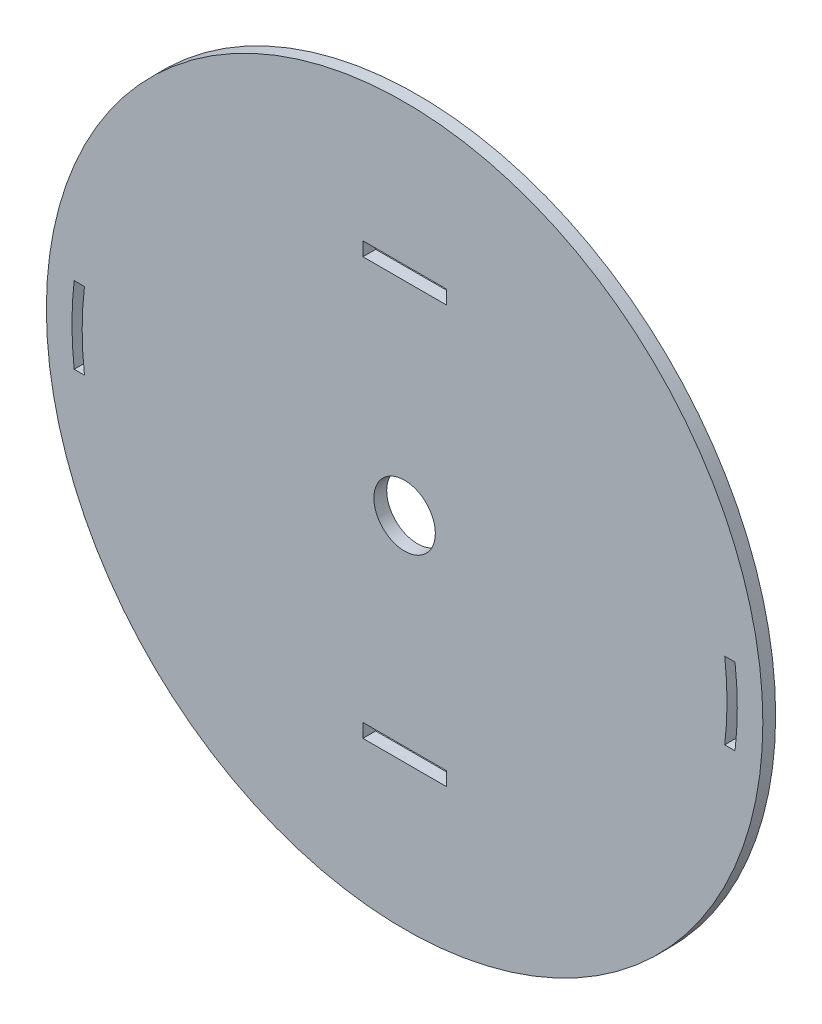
ISO-10303-21;
HEADER;
FILE_DESCRIPTION(('STEP AP214'),'2;1');
FILE_NAME('part.step','',(''),(''),'','','');
FILE_SCHEMA(('AUTOMOTIVE_DESIGN { 1 0 10303 214 1 1 1 1 }'));
ENDSEC;
DATA;
#1=APPLICATION_CONTEXT('core data for automotive mechanical design processes');
#2=APPLICATION_PROTOCOL_DEFINITION('international standard','automotive_design',2000,#1);
#3=PRODUCT_CONTEXT('',#1,'mechanical');
#4=PRODUCT('Part','Part','',(#3));
#5=PRODUCT_RELATED_PRODUCT_CATEGORY('part','',(#4));
#6=PRODUCT_DEFINITION_FORMATION('','',#4);
#7=PRODUCT_DEFINITION_CONTEXT('part definition',#1,'design');
#8=PRODUCT_DEFINITION('design','',#6,#7);
#9=PRODUCT_DEFINITION_SHAPE('','',#8);
#10=(LENGTH_UNIT() NAMED_UNIT(*) SI_UNIT(.MILLI.,.METRE.));
#11=(NAMED_UNIT(*) PLANE_ANGLE_UNIT() SI_UNIT($,.RADIAN.));
#12=(NAMED_UNIT(*) SI_UNIT($,.STERADIAN.) SOLID_ANGLE_UNIT());
#13=UNCERTAINTY_MEASURE_WITH_UNIT(LENGTH_MEASURE(1.E-05),#10,'distance_accuracy_value','');
#14=(GEOMETRIC_REPRESENTATION_CONTEXT(3) GLOBAL_UNCERTAINTY_ASSIGNED_CONTEXT((#13)) GLOBAL_UNIT_ASSIGNED_CONTEXT((#10,
#11,#12)) REPRESENTATION_CONTEXT('',''));
#15=CARTESIAN_POINT('',(0.,0.,0.));
#16=DIRECTION('',(0.,0.,1.));
#17=DIRECTION('',(1.,0.,0.));
#18=AXIS2_PLACEMENT_3D('',#15,#16,#17);
#19=CARTESIAN_POINT('',(0.,39.1553072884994,2.5));
#20=DIRECTION('',(0.,0.,1.));
#21=DIRECTION('',(1.,0.,0.));
#22=AXIS2_PLACEMENT_3D('',#19,#20,#21);
#23=PLANE('',#22);
#24=CARTESIAN_POINT('',(0.,39.1553072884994,2.5));
#25=DIRECTION('',(0.,0.,1.));
#26=DIRECTION('',(1.,0.,0.));
#27=AXIS2_PLACEMENT_3D('',#24,#25,#26);
#28=CIRCLE('',#27,6.);
#29=CARTESIAN_POINT('',(5.99999999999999,39.1553072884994,2.5));
#30=VERTEX_POINT('',#29);
#31=EDGE_CURVE('E180',#30,#30,#28,.T.);
#32=ORIENTED_EDGE('',*,*,#31,.F.);
#33=EDGE_LOOP('',(#32));
#34=FACE_BOUND('',#33,.T.);
#35=CARTESIAN_POINT('',(0.,39.1553072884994,2.5));
#36=DIRECTION('',(0.,0.,1.));
#37=DIRECTION('',(1.,0.,0.));
#38=AXIS2_PLACEMENT_3D('',#35,#36,#37);
#39=CIRCLE('',#38,70.0000000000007);
#40=CARTESIAN_POINT('',(70.0000000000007,39.1553072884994,2.5));
#41=VERTEX_POINT('',#40);
#42=EDGE_CURVE('E11',#41,#41,#39,.T.);
#43=ORIENTED_EDGE('',*,*,#42,.T.);
#44=EDGE_LOOP('',(#43));
#45=FACE_BOUND('',#44,.T.);
#46=DIRECTION('',(-1.,0.,0.));
#47=VECTOR('',#46,1.);
#48=CARTESIAN_POINT('',(62.5519783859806,46.6553072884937,2.5));
#49=LINE('',#48,#47);
#50=CARTESIAN_POINT('',(64.5658578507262,46.6553072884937,2.5));
#51=VERTEX_POINT('',#50);
#52=CARTESIAN_POINT('',(62.5519783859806,46.6553072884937,2.5));
#53=VERTEX_POINT('',#52);
#54=EDGE_CURVE('E254',#51,#53,#49,.T.);
#55=ORIENTED_EDGE('',*,*,#54,.F.);
#56=CARTESIAN_POINT('',(0.,39.1553072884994,2.5));
#57=DIRECTION('',(0.,0.,1.));
#58=DIRECTION('',(1.,0.,0.));
#59=AXIS2_PLACEMENT_3D('',#56,#57,#58);
#60=CIRCLE('',#59,65.0000000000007);
#61=CARTESIAN_POINT('',(64.5658578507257,31.6553072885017,2.5));
#62=VERTEX_POINT('',#61);
#63=EDGE_CURVE('E252',#62,#51,#60,.T.);
#64=ORIENTED_EDGE('',*,*,#63,.F.);
#65=DIRECTION('',(1.,0.,0.));
#66=VECTOR('',#65,1.);
#67=CARTESIAN_POINT('',(62.5519783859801,31.6553072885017,2.5));
#68=LINE('',#67,#66);
#69=CARTESIAN_POINT('',(62.5519783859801,31.6553072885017,2.5));
#70=VERTEX_POINT('',#69);
#71=EDGE_CURVE('E260',#70,#62,#68,.T.);
#72=ORIENTED_EDGE('',*,*,#71,.F.);
#73=CARTESIAN_POINT('',(0.,39.1553072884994,2.5));
#74=DIRECTION('',(0.,0.,-1.));
#75=DIRECTION('',(1.,0.,0.));
#76=AXIS2_PLACEMENT_3D('',#73,#74,#75);
#77=CIRCLE('',#76,63.0000000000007);
#78=EDGE_CURVE('E257',#53,#70,#77,.T.);
#79=ORIENTED_EDGE('',*,*,#78,.F.);
#80=EDGE_LOOP('',(#55,#64,#72,#79));
#81=FACE_BOUND('',#80,.T.);
#82=DIRECTION('',(-1.,0.,0.));
#83=VECTOR('',#82,1.);
#84=CARTESIAN_POINT('',(8.14910129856,0.1,2.5));
#85=LINE('',#84,#83);
#86=CARTESIAN_POINT('',(8.14910129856,0.1,2.5));
#87=VERTEX_POINT('',#86);
#88=CARTESIAN_POINT('',(-8.149101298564,0.1,2.5));
#89=VERTEX_POINT('',#88);
#90=EDGE_CURVE('E223',#87,#89,#85,.T.);
#91=ORIENTED_EDGE('',*,*,#90,.F.);
#92=DIRECTION('',(0.,1.,0.));
#93=VECTOR('',#92,1.);
#94=CARTESIAN_POINT('',(8.14910129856,-2.6,2.5));
#95=LINE('',#94,#93);
#96=CARTESIAN_POINT('',(8.14910129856,-2.6,2.5));
#97=VERTEX_POINT('',#96);
#98=EDGE_CURVE('E221',#97,#87,#95,.T.);
#99=ORIENTED_EDGE('',*,*,#98,.F.);
#100=DIRECTION('',(1.,0.,0.));
#101=VECTOR('',#100,1.);
#102=CARTESIAN_POINT('',(-8.149101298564,-2.6,2.5));
#103=LINE('',#102,#101);
#104=CARTESIAN_POINT('',(-8.149101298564,-2.6,2.5));
#105=VERTEX_POINT('',#104);
#106=EDGE_CURVE('E229',#105,#97,#103,.T.);
#107=ORIENTED_EDGE('',*,*,#106,.F.);
#108=DIRECTION('',(0.,-1.,0.));
#109=VECTOR('',#108,1.);
#110=CARTESIAN_POINT('',(-8.149101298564,0.1,2.5));
#111=LINE('',#110,#109);
#112=EDGE_CURVE('E226',#89,#105,#111,.T.);
#113=ORIENTED_EDGE('',*,*,#112,.F.);
#114=EDGE_LOOP('',(#91,#99,#107,#113));
#115=FACE_BOUND('',#114,.T.);
#116=DIRECTION('',(-1.,0.,0.));
#117=VECTOR('',#116,1.);
#118=CARTESIAN_POINT('',(-64.5658578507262,46.6553072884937,2.5));
#119=LINE('',#118,#117);
#120=CARTESIAN_POINT('',(-62.5519783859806,46.6553072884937,2.5));
#121=VERTEX_POINT('',#120);
#122=CARTESIAN_POINT('',(-64.5658578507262,46.6553072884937,2.5));
#123=VERTEX_POINT('',#122);
#124=EDGE_CURVE('E192',#121,#123,#119,.T.);
#125=ORIENTED_EDGE('',*,*,#124,.F.);
#126=CARTESIAN_POINT('',(0.,39.1553072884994,2.5));
#127=DIRECTION('',(0.,0.,-1.));
#128=DIRECTION('',(1.,0.,0.));
#129=AXIS2_PLACEMENT_3D('',#126,#127,#128);
#130=CIRCLE('',#129,63.0000000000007);
#131=CARTESIAN_POINT('',(-62.55197838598,31.6553072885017,2.5));
#132=VERTEX_POINT('',#131);
#133=EDGE_CURVE('E190',#132,#121,#130,.T.);
#134=ORIENTED_EDGE('',*,*,#133,.F.);
#135=DIRECTION('',(1.,0.,0.));
#136=VECTOR('',#135,1.);
#137=CARTESIAN_POINT('',(-64.5658578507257,31.6553072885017,2.5));
#138=LINE('',#137,#136);
#139=CARTESIAN_POINT('',(-64.5658578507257,31.6553072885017,2.5));
#140=VERTEX_POINT('',#139);
#141=EDGE_CURVE('E198',#140,#132,#138,.T.);
#142=ORIENTED_EDGE('',*,*,#141,.F.);
#143=CARTESIAN_POINT('',(0.,39.1553072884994,2.5));
#144=DIRECTION('',(0.,0.,1.));
#145=DIRECTION('',(1.,0.,0.));
#146=AXIS2_PLACEMENT_3D('',#143,#144,#145);
#147=CIRCLE('',#146,65.0000000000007);
#148=EDGE_CURVE('E195',#123,#140,#147,.T.);
#149=ORIENTED_EDGE('',*,*,#148,.F.);
#150=EDGE_LOOP('',(#125,#134,#142,#149));
#151=FACE_BOUND('',#150,.T.);
#152=DIRECTION('',(1.,0.,0.));
#153=VECTOR('',#152,1.);
#154=CARTESIAN_POINT('',(-8.149101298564,78.89999999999,2.5));
#155=LINE('',#154,#153);
#156=CARTESIAN_POINT('',(-8.149101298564,78.89999999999,2.5));
#157=VERTEX_POINT('',#156);
#158=CARTESIAN_POINT('',(8.14910129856,78.89999999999,2.5));
#159=VERTEX_POINT('',#158);
#160=EDGE_CURVE('E160',#157,#159,#155,.T.);
#161=ORIENTED_EDGE('',*,*,#160,.F.);
#162=DIRECTION('',(0.,-1.,0.));
#163=VECTOR('',#162,1.);
#164=CARTESIAN_POINT('',(-8.149101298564,81.59999999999,2.5));
#165=LINE('',#164,#163);
#166=CARTESIAN_POINT('',(-8.149101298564,81.59999999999,2.5));
#167=VERTEX_POINT('',#166);
#168=EDGE_CURVE('E152',#167,#157,#165,.T.);
#169=ORIENTED_EDGE('',*,*,#168,.F.);
#170=DIRECTION('',(-1.,0.,0.));
#171=VECTOR('',#170,1.);
#172=CARTESIAN_POINT('',(8.14910129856,81.59999999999,2.5));
#173=LINE('',#172,#171);
#174=CARTESIAN_POINT('',(8.14910129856,81.59999999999,2.5));
#175=VERTEX_POINT('',#174);
#176=EDGE_CURVE('E174',#175,#167,#173,.T.);
#177=ORIENTED_EDGE('',*,*,#176,.F.);
#178=DIRECTION('',(0.,1.,0.));
#179=VECTOR('',#178,1.);
#180=CARTESIAN_POINT('',(8.14910129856,78.89999999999,2.5));
#181=LINE('',#180,#179);
#182=EDGE_CURVE('E172',#159,#175,#181,.T.);
#183=ORIENTED_EDGE('',*,*,#182,.F.);
#184=EDGE_LOOP('',(#161,#169,#177,#183));
#185=FACE_BOUND('',#184,.T.);
#186=ADVANCED_FACE('F39',(#34,#45,#81,#115,#151,#185),#23,.T.);
#187=CARTESIAN_POINT('',(0.,39.1553072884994,0.));
#188=DIRECTION('',(0.,0.,1.));
#189=DIRECTION('',(1.,0.,0.));
#190=AXIS2_PLACEMENT_3D('',#187,#188,#189);
#191=PLANE('',#190);
#192=CARTESIAN_POINT('',(0.,39.1553072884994,0.));
#193=DIRECTION('',(0.,0.,-1.));
#194=DIRECTION('',(-1.,0.,0.));
#195=AXIS2_PLACEMENT_3D('',#192,#193,#194);
#196=CIRCLE('',#195,6.);
#197=CARTESIAN_POINT('',(-6.00000000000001,39.1553072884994,0.));
#198=VERTEX_POINT('',#197);
#199=EDGE_CURVE('E557',#198,#198,#196,.T.);
#200=ORIENTED_EDGE('',*,*,#199,.F.);
#201=EDGE_LOOP('',(#200));
#202=FACE_BOUND('',#201,.T.);
#203=CARTESIAN_POINT('',(0.,39.1553072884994,0.));
#204=DIRECTION('',(0.,0.,-1.));
#205=DIRECTION('',(1.,0.,0.));
#206=AXIS2_PLACEMENT_3D('',#203,#204,#205);
#207=CIRCLE('',#206,63.0000000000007);
#208=CARTESIAN_POINT('',(-62.55197838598,31.6553072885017,0.));
#209=VERTEX_POINT('',#208);
#210=CARTESIAN_POINT('',(-62.5519783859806,46.6553072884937,0.));
#211=VERTEX_POINT('',#210);
#212=EDGE_CURVE('E168',#209,#211,#207,.T.);
#213=ORIENTED_EDGE('',*,*,#212,.T.);
#214=DIRECTION('',(-1.,0.,0.));
#215=VECTOR('',#214,1.);
#216=CARTESIAN_POINT('',(-64.5658578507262,46.6553072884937,0.));
#217=LINE('',#216,#215);
#218=CARTESIAN_POINT('',(-64.5658578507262,46.6553072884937,0.));
#219=VERTEX_POINT('',#218);
#220=EDGE_CURVE('E203',#211,#219,#217,.T.);
#221=ORIENTED_EDGE('',*,*,#220,.T.);
#222=CARTESIAN_POINT('',(0.,39.1553072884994,0.));
#223=DIRECTION('',(0.,0.,1.));
#224=DIRECTION('',(1.,0.,0.));
#225=AXIS2_PLACEMENT_3D('',#222,#223,#224);
#226=CIRCLE('',#225,65.0000000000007);
#227=CARTESIAN_POINT('',(-64.5658578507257,31.6553072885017,0.));
#228=VERTEX_POINT('',#227);
#229=EDGE_CURVE('E206',#219,#228,#226,.T.);
#230=ORIENTED_EDGE('',*,*,#229,.T.);
#231=DIRECTION('',(1.,0.,0.));
#232=VECTOR('',#231,1.);
#233=CARTESIAN_POINT('',(-64.5658578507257,31.6553072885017,0.));
#234=LINE('',#233,#232);
#235=EDGE_CURVE('E193',#228,#209,#234,.T.);
#236=ORIENTED_EDGE('',*,*,#235,.T.);
#237=EDGE_LOOP('',(#213,#221,#230,#236));
#238=FACE_BOUND('',#237,.T.);
#239=CARTESIAN_POINT('',(0.,39.1553072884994,0.));
#240=DIRECTION('',(0.,0.,1.));
#241=DIRECTION('',(1.,0.,0.));
#242=AXIS2_PLACEMENT_3D('',#239,#240,#241);
#243=CIRCLE('',#242,65.0000000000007);
#244=CARTESIAN_POINT('',(64.5658578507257,31.6553072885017,0.));
#245=VERTEX_POINT('',#244);
#246=CARTESIAN_POINT('',(64.5658578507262,46.6553072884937,0.));
#247=VERTEX_POINT('',#246);
#248=EDGE_CURVE('E251',#245,#247,#243,.T.);
#249=ORIENTED_EDGE('',*,*,#248,.T.);
#250=DIRECTION('',(-1.,0.,0.));
#251=VECTOR('',#250,1.);
#252=CARTESIAN_POINT('',(62.5519783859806,46.6553072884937,0.));
#253=LINE('',#252,#251);
#254=CARTESIAN_POINT('',(62.5519783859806,46.6553072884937,0.));
#255=VERTEX_POINT('',#254);
#256=EDGE_CURVE('E265',#247,#255,#253,.T.);
#257=ORIENTED_EDGE('',*,*,#256,.T.);
#258=CARTESIAN_POINT('',(0.,39.1553072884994,0.));
#259=DIRECTION('',(0.,0.,-1.));
#260=DIRECTION('',(1.,0.,0.));
#261=AXIS2_PLACEMENT_3D('',#258,#259,#260);
#262=CIRCLE('',#261,63.0000000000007);
#263=CARTESIAN_POINT('',(62.5519783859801,31.6553072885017,0.));
#264=VERTEX_POINT('',#263);
#265=EDGE_CURVE('E268',#255,#264,#262,.T.);
#266=ORIENTED_EDGE('',*,*,#265,.T.);
#267=DIRECTION('',(1.,0.,0.));
#268=VECTOR('',#267,1.);
#269=CARTESIAN_POINT('',(62.5519783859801,31.6553072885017,0.));
#270=LINE('',#269,#268);
#271=EDGE_CURVE('E255',#264,#245,#270,.T.);
#272=ORIENTED_EDGE('',*,*,#271,.T.);
#273=EDGE_LOOP('',(#249,#257,#266,#272));
#274=FACE_BOUND('',#273,.T.);
#275=CARTESIAN_POINT('',(0.,39.1553072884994,0.));
#276=DIRECTION('',(0.,0.,1.));
#277=DIRECTION('',(1.,0.,0.));
#278=AXIS2_PLACEMENT_3D('',#275,#276,#277);
#279=CIRCLE('',#278,70.0000000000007);
#280=CARTESIAN_POINT('',(70.0000000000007,39.1553072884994,0.));
#281=VERTEX_POINT('',#280);
#282=EDGE_CURVE('E43',#281,#281,#279,.T.);
#283=ORIENTED_EDGE('',*,*,#282,.F.);
#284=EDGE_LOOP('',(#283));
#285=FACE_BOUND('',#284,.T.);
#286=DIRECTION('',(0.,1.,0.));
#287=VECTOR('',#286,1.);
#288=CARTESIAN_POINT('',(8.14910129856,-2.6,0.));
#289=LINE('',#288,#287);
#290=CARTESIAN_POINT('',(8.14910129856,-2.6,0.));
#291=VERTEX_POINT('',#290);
#292=CARTESIAN_POINT('',(8.14910129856,0.1,0.));
#293=VERTEX_POINT('',#292);
#294=EDGE_CURVE('E220',#291,#293,#289,.T.);
#295=ORIENTED_EDGE('',*,*,#294,.T.);
#296=DIRECTION('',(-1.,0.,0.));
#297=VECTOR('',#296,1.);
#298=CARTESIAN_POINT('',(8.14910129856,0.1,0.));
#299=LINE('',#298,#297);
#300=CARTESIAN_POINT('',(-8.149101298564,0.1,0.));
#301=VERTEX_POINT('',#300);
#302=EDGE_CURVE('E234',#293,#301,#299,.T.);
#303=ORIENTED_EDGE('',*,*,#302,.T.);
#304=DIRECTION('',(0.,-1.,0.));
#305=VECTOR('',#304,1.);
#306=CARTESIAN_POINT('',(-8.149101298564,0.1,0.));
#307=LINE('',#306,#305);
#308=CARTESIAN_POINT('',(-8.149101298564,-2.6,0.));
#309=VERTEX_POINT('',#308);
#310=EDGE_CURVE('E237',#301,#309,#307,.T.);
#311=ORIENTED_EDGE('',*,*,#310,.T.);
#312=DIRECTION('',(1.,0.,0.));
#313=VECTOR('',#312,1.);
#314=CARTESIAN_POINT('',(-8.149101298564,-2.6,0.));
#315=LINE('',#314,#313);
#316=EDGE_CURVE('E224',#309,#291,#315,.T.);
#317=ORIENTED_EDGE('',*,*,#316,.T.);
#318=EDGE_LOOP('',(#295,#303,#311,#317));
#319=FACE_BOUND('',#318,.T.);
#320=DIRECTION('',(0.,-1.,0.));
#321=VECTOR('',#320,1.);
#322=CARTESIAN_POINT('',(-8.149101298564,81.59999999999,0.));
#323=LINE('',#322,#321);
#324=CARTESIAN_POINT('',(-8.149101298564,81.59999999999,0.));
#325=VERTEX_POINT('',#324);
#326=CARTESIAN_POINT('',(-8.149101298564,78.89999999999,0.));
#327=VERTEX_POINT('',#326);
#328=EDGE_CURVE('E62',#325,#327,#323,.T.);
#329=ORIENTED_EDGE('',*,*,#328,.T.);
#330=DIRECTION('',(1.,0.,0.));
#331=VECTOR('',#330,1.);
#332=CARTESIAN_POINT('',(-8.149101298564,78.89999999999,0.));
#333=LINE('',#332,#331);
#334=CARTESIAN_POINT('',(8.14910129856,78.89999999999,0.));
#335=VERTEX_POINT('',#334);
#336=EDGE_CURVE('E167',#327,#335,#333,.T.);
#337=ORIENTED_EDGE('',*,*,#336,.T.);
#338=DIRECTION('',(0.,1.,0.));
#339=VECTOR('',#338,1.);
#340=CARTESIAN_POINT('',(8.14910129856,78.89999999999,0.));
#341=LINE('',#340,#339);
#342=CARTESIAN_POINT('',(8.14910129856,81.59999999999,0.));
#343=VERTEX_POINT('',#342);
#344=EDGE_CURVE('E182',#335,#343,#341,.T.);
#345=ORIENTED_EDGE('',*,*,#344,.T.);
#346=DIRECTION('',(-1.,0.,0.));
#347=VECTOR('',#346,1.);
#348=CARTESIAN_POINT('',(8.14910129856,81.59999999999,0.));
#349=LINE('',#348,#347);
#350=EDGE_CURVE('E161',#343,#325,#349,.T.);
#351=ORIENTED_EDGE('',*,*,#350,.T.);
#352=EDGE_LOOP('',(#329,#337,#345,#351));
#353=FACE_BOUND('',#352,.T.);
#354=ADVANCED_FACE('F287',(#202,#238,#274,#285,#319,#353),#191,.F.);
#355=CARTESIAN_POINT('',(0.,39.1553072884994,2.5));
#356=DIRECTION('',(0.,0.,-1.));
#357=DIRECTION('',(-1.,0.,0.));
#358=AXIS2_PLACEMENT_3D('',#355,#356,#357);
#359=CYLINDRICAL_SURFACE('',#358,70.0000000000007);
#360=ORIENTED_EDGE('',*,*,#42,.F.);
#361=EDGE_LOOP('',(#360));
#362=FACE_BOUND('',#361,.T.);
#363=ORIENTED_EDGE('',*,*,#282,.T.);
#364=EDGE_LOOP('',(#363));
#365=FACE_BOUND('',#364,.T.);
#366=ADVANCED_FACE('F41',(#362,#365),#359,.T.);
#367=CARTESIAN_POINT('',(0.,39.1553072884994,2.5));
#368=DIRECTION('',(0.,0.,-1.));
#369=DIRECTION('',(-1.,0.,0.));
#370=AXIS2_PLACEMENT_3D('',#367,#368,#369);
#371=CYLINDRICAL_SURFACE('',#370,65.0000000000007);
#372=ORIENTED_EDGE('',*,*,#248,.F.);
#373=DIRECTION('',(0.,0.,-1.));
#374=VECTOR('',#373,1.);
#375=CARTESIAN_POINT('',(64.5658578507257,31.6553072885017,2.5));
#376=LINE('',#375,#374);
#377=EDGE_CURVE('E262',#62,#245,#376,.T.);
#378=ORIENTED_EDGE('',*,*,#377,.F.);
#379=ORIENTED_EDGE('',*,*,#63,.T.);
#380=DIRECTION('',(0.,0.,-1.));
#381=VECTOR('',#380,1.);
#382=CARTESIAN_POINT('',(64.5658578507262,46.6553072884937,2.5));
#383=LINE('',#382,#381);
#384=EDGE_CURVE('E279',#51,#247,#383,.T.);
#385=ORIENTED_EDGE('',*,*,#384,.T.);
#386=EDGE_LOOP('',(#372,#378,#379,#385));
#387=FACE_BOUND('',#386,.T.);
#388=ADVANCED_FACE('F314',(#387),#371,.F.);
#389=CARTESIAN_POINT('',(62.5519783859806,46.6553072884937,2.5));
#390=DIRECTION('',(0.,-1.,0.));
#391=DIRECTION('',(1.,0.,0.));
#392=AXIS2_PLACEMENT_3D('',#389,#390,#391);
#393=PLANE('',#392);
#394=ORIENTED_EDGE('',*,*,#256,.F.);
#395=ORIENTED_EDGE('',*,*,#384,.F.);
#396=ORIENTED_EDGE('',*,*,#54,.T.);
#397=DIRECTION('',(0.,0.,-1.));
#398=VECTOR('',#397,1.);
#399=CARTESIAN_POINT('',(62.5519783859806,46.6553072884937,2.5));
#400=LINE('',#399,#398);
#401=EDGE_CURVE('E277',#53,#255,#400,.T.);
#402=ORIENTED_EDGE('',*,*,#401,.T.);
#403=EDGE_LOOP('',(#394,#395,#396,#402));
#404=FACE_BOUND('',#403,.T.);
#405=ADVANCED_FACE('F317',(#404),#393,.T.);
#406=CARTESIAN_POINT('',(0.,39.1553072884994,2.5));
#407=DIRECTION('',(0.,0.,-1.));
#408=DIRECTION('',(-1.,0.,0.));
#409=AXIS2_PLACEMENT_3D('',#406,#407,#408);
#410=CYLINDRICAL_SURFACE('',#409,63.0000000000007);
#411=ORIENTED_EDGE('',*,*,#265,.F.);
#412=ORIENTED_EDGE('',*,*,#401,.F.);
#413=ORIENTED_EDGE('',*,*,#78,.T.);
#414=DIRECTION('',(0.,0.,-1.));
#415=VECTOR('',#414,1.);
#416=CARTESIAN_POINT('',(62.5519783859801,31.6553072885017,2.5));
#417=LINE('',#416,#415);
#418=EDGE_CURVE('E275',#70,#264,#417,.T.);
#419=ORIENTED_EDGE('',*,*,#418,.T.);
#420=EDGE_LOOP('',(#411,#412,#413,#419));
#421=FACE_BOUND('',#420,.T.);
#422=ADVANCED_FACE('F320',(#421),#410,.T.);
#423=CARTESIAN_POINT('',(62.5519783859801,31.6553072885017,2.5));
#424=DIRECTION('',(0.,1.,0.));
#425=DIRECTION('',(0.,0.,1.));
#426=AXIS2_PLACEMENT_3D('',#423,#424,#425);
#427=PLANE('',#426);
#428=ORIENTED_EDGE('',*,*,#271,.F.);
#429=ORIENTED_EDGE('',*,*,#418,.F.);
#430=ORIENTED_EDGE('',*,*,#71,.T.);
#431=ORIENTED_EDGE('',*,*,#377,.T.);
#432=EDGE_LOOP('',(#428,#429,#430,#431));
#433=FACE_BOUND('',#432,.T.);
#434=ADVANCED_FACE('F324',(#433),#427,.T.);
#435=CARTESIAN_POINT('',(8.14910129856,-2.6,2.5));
#436=DIRECTION('',(-1.,0.,0.));
#437=DIRECTION('',(0.,0.,1.));
#438=AXIS2_PLACEMENT_3D('',#435,#436,#437);
#439=PLANE('',#438);
#440=ORIENTED_EDGE('',*,*,#294,.F.);
#441=DIRECTION('',(0.,0.,-1.));
#442=VECTOR('',#441,1.);
#443=CARTESIAN_POINT('',(8.14910129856,-2.6,2.5));
#444=LINE('',#443,#442);
#445=EDGE_CURVE('E231',#97,#291,#444,.T.);
#446=ORIENTED_EDGE('',*,*,#445,.F.);
#447=ORIENTED_EDGE('',*,*,#98,.T.);
#448=DIRECTION('',(0.,0.,-1.));
#449=VECTOR('',#448,1.);
#450=CARTESIAN_POINT('',(8.14910129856,0.1,2.5));
#451=LINE('',#450,#449);
#452=EDGE_CURVE('E248',#87,#293,#451,.T.);
#453=ORIENTED_EDGE('',*,*,#452,.T.);
#454=EDGE_LOOP('',(#440,#446,#447,#453));
#455=FACE_BOUND('',#454,.T.);
#456=ADVANCED_FACE('F328',(#455),#439,.T.);
#457=CARTESIAN_POINT('',(8.14910129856,0.1,2.5));
#458=DIRECTION('',(0.,-1.,0.));
#459=DIRECTION('',(0.,0.,-1.));
#460=AXIS2_PLACEMENT_3D('',#457,#458,#459);
#461=PLANE('',#460);
#462=ORIENTED_EDGE('',*,*,#302,.F.);
#463=ORIENTED_EDGE('',*,*,#452,.F.);
#464=ORIENTED_EDGE('',*,*,#90,.T.);
#465=DIRECTION('',(0.,0.,-1.));
#466=VECTOR('',#465,1.);
#467=CARTESIAN_POINT('',(-8.149101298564,0.1,2.5));
#468=LINE('',#467,#466);
#469=EDGE_CURVE('E246',#89,#301,#468,.T.);
#470=ORIENTED_EDGE('',*,*,#469,.T.);
#471=EDGE_LOOP('',(#462,#463,#464,#470));
#472=FACE_BOUND('',#471,.T.);
#473=ADVANCED_FACE('F332',(#472),#461,.T.);
#474=CARTESIAN_POINT('',(-8.149101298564,0.1,2.5));
#475=DIRECTION('',(1.,0.,0.));
#476=DIRECTION('',(0.,0.,-1.));
#477=AXIS2_PLACEMENT_3D('',#474,#475,#476);
#478=PLANE('',#477);
#479=ORIENTED_EDGE('',*,*,#310,.F.);
#480=ORIENTED_EDGE('',*,*,#469,.F.);
#481=ORIENTED_EDGE('',*,*,#112,.T.);
#482=DIRECTION('',(0.,0.,-1.));
#483=VECTOR('',#482,1.);
#484=CARTESIAN_POINT('',(-8.149101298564,-2.6,2.5));
#485=LINE('',#484,#483);
#486=EDGE_CURVE('E244',#105,#309,#485,.T.);
#487=ORIENTED_EDGE('',*,*,#486,.T.);
#488=EDGE_LOOP('',(#479,#480,#481,#487));
#489=FACE_BOUND('',#488,.T.);
#490=ADVANCED_FACE('F336',(#489),#478,.T.);
#491=CARTESIAN_POINT('',(-8.149101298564,-2.6,2.5));
#492=DIRECTION('',(0.,1.,0.));
#493=DIRECTION('',(0.,0.,1.));
#494=AXIS2_PLACEMENT_3D('',#491,#492,#493);
#495=PLANE('',#494);
#496=ORIENTED_EDGE('',*,*,#316,.F.);
#497=ORIENTED_EDGE('',*,*,#486,.F.);
#498=ORIENTED_EDGE('',*,*,#106,.T.);
#499=ORIENTED_EDGE('',*,*,#445,.T.);
#500=EDGE_LOOP('',(#496,#497,#498,#499));
#501=FACE_BOUND('',#500,.T.);
#502=ADVANCED_FACE('F340',(#501),#495,.T.);
#503=CARTESIAN_POINT('',(0.,39.1553072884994,2.5));
#504=DIRECTION('',(0.,0.,-1.));
#505=DIRECTION('',(-1.,0.,0.));
#506=AXIS2_PLACEMENT_3D('',#503,#504,#505);
#507=CYLINDRICAL_SURFACE('',#506,63.0000000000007);
#508=ORIENTED_EDGE('',*,*,#212,.F.);
#509=DIRECTION('',(0.,0.,-1.));
#510=VECTOR('',#509,1.);
#511=CARTESIAN_POINT('',(-62.55197838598,31.6553072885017,2.5));
#512=LINE('',#511,#510);
#513=EDGE_CURVE('E200',#132,#209,#512,.T.);
#514=ORIENTED_EDGE('',*,*,#513,.F.);
#515=ORIENTED_EDGE('',*,*,#133,.T.);
#516=DIRECTION('',(0.,0.,-1.));
#517=VECTOR('',#516,1.);
#518=CARTESIAN_POINT('',(-62.5519783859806,46.6553072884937,2.5));
#519=LINE('',#518,#517);
#520=EDGE_CURVE('E217',#121,#211,#519,.T.);
#521=ORIENTED_EDGE('',*,*,#520,.T.);
#522=EDGE_LOOP('',(#508,#514,#515,#521));
#523=FACE_BOUND('',#522,.T.);
#524=ADVANCED_FACE('F344',(#523),#507,.T.);
#525=CARTESIAN_POINT('',(-64.5658578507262,46.6553072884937,2.5));
#526=DIRECTION('',(0.,-1.,0.));
#527=DIRECTION('',(1.,0.,0.));
#528=AXIS2_PLACEMENT_3D('',#525,#526,#527);
#529=PLANE('',#528);
#530=ORIENTED_EDGE('',*,*,#220,.F.);
#531=ORIENTED_EDGE('',*,*,#520,.F.);
#532=ORIENTED_EDGE('',*,*,#124,.T.);
#533=DIRECTION('',(0.,0.,-1.));
#534=VECTOR('',#533,1.);
#535=CARTESIAN_POINT('',(-64.5658578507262,46.6553072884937,2.5));
#536=LINE('',#535,#534);
#537=EDGE_CURVE('E215',#123,#219,#536,.T.);
#538=ORIENTED_EDGE('',*,*,#537,.T.);
#539=EDGE_LOOP('',(#530,#531,#532,#538));
#540=FACE_BOUND('',#539,.T.);
#541=ADVANCED_FACE('F348',(#540),#529,.T.);
#542=CARTESIAN_POINT('',(0.,39.1553072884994,2.5));
#543=DIRECTION('',(0.,0.,-1.));
#544=DIRECTION('',(-1.,0.,0.));
#545=AXIS2_PLACEMENT_3D('',#542,#543,#544);
#546=CYLINDRICAL_SURFACE('',#545,65.0000000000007);
#547=ORIENTED_EDGE('',*,*,#229,.F.);
#548=ORIENTED_EDGE('',*,*,#537,.F.);
#549=ORIENTED_EDGE('',*,*,#148,.T.);
#550=DIRECTION('',(0.,0.,-1.));
#551=VECTOR('',#550,1.);
#552=CARTESIAN_POINT('',(-64.5658578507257,31.6553072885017,2.5));
#553=LINE('',#552,#551);
#554=EDGE_CURVE('E213',#140,#228,#553,.T.);
#555=ORIENTED_EDGE('',*,*,#554,.T.);
#556=EDGE_LOOP('',(#547,#548,#549,#555));
#557=FACE_BOUND('',#556,.T.);
#558=ADVANCED_FACE('F352',(#557),#546,.F.);
#559=CARTESIAN_POINT('',(-64.5658578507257,31.6553072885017,2.5));
#560=DIRECTION('',(0.,1.,0.));
#561=DIRECTION('',(0.,0.,1.));
#562=AXIS2_PLACEMENT_3D('',#559,#560,#561);
#563=PLANE('',#562);
#564=ORIENTED_EDGE('',*,*,#235,.F.);
#565=ORIENTED_EDGE('',*,*,#554,.F.);
#566=ORIENTED_EDGE('',*,*,#141,.T.);
#567=ORIENTED_EDGE('',*,*,#513,.T.);
#568=EDGE_LOOP('',(#564,#565,#566,#567));
#569=FACE_BOUND('',#568,.T.);
#570=ADVANCED_FACE('F356',(#569),#563,.T.);
#571=CARTESIAN_POINT('',(-8.149101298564,81.59999999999,2.5));
#572=DIRECTION('',(1.,0.,0.));
#573=DIRECTION('',(0.,0.,-1.));
#574=AXIS2_PLACEMENT_3D('',#571,#572,#573);
#575=PLANE('',#574);
#576=ORIENTED_EDGE('',*,*,#328,.F.);
#577=DIRECTION('',(0.,0.,-1.));
#578=VECTOR('',#577,1.);
#579=CARTESIAN_POINT('',(-8.149101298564,81.59999999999,2.5));
#580=LINE('',#579,#578);
#581=EDGE_CURVE('E156',#167,#325,#580,.T.);
#582=ORIENTED_EDGE('',*,*,#581,.F.);
#583=ORIENTED_EDGE('',*,*,#168,.T.);
#584=DIRECTION('',(0.,0.,-1.));
#585=VECTOR('',#584,1.);
#586=CARTESIAN_POINT('',(-8.149101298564,78.89999999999,2.5));
#587=LINE('',#586,#585);
#588=EDGE_CURVE('E155',#157,#327,#587,.T.);
#589=ORIENTED_EDGE('',*,*,#588,.T.);
#590=EDGE_LOOP('',(#576,#582,#583,#589));
#591=FACE_BOUND('',#590,.T.);
#592=ADVANCED_FACE('F154',(#591),#575,.T.);
#593=CARTESIAN_POINT('',(-8.149101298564,78.89999999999,2.5));
#594=DIRECTION('',(0.,1.,0.));
#595=DIRECTION('',(0.,0.,1.));
#596=AXIS2_PLACEMENT_3D('',#593,#594,#595);
#597=PLANE('',#596);
#598=ORIENTED_EDGE('',*,*,#336,.F.);
#599=ORIENTED_EDGE('',*,*,#588,.F.);
#600=ORIENTED_EDGE('',*,*,#160,.T.);
#601=DIRECTION('',(0.,0.,-1.));
#602=VECTOR('',#601,1.);
#603=CARTESIAN_POINT('',(8.14910129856,78.89999999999,2.5));
#604=LINE('',#603,#602);
#605=EDGE_CURVE('E169',#159,#335,#604,.T.);
#606=ORIENTED_EDGE('',*,*,#605,.T.);
#607=EDGE_LOOP('',(#598,#599,#600,#606));
#608=FACE_BOUND('',#607,.T.);
#609=ADVANCED_FACE('F164',(#608),#597,.T.);
#610=CARTESIAN_POINT('',(8.14910129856,78.89999999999,2.5));
#611=DIRECTION('',(-1.,0.,0.));
#612=DIRECTION('',(0.,0.,1.));
#613=AXIS2_PLACEMENT_3D('',#610,#611,#612);
#614=PLANE('',#613);
#615=ORIENTED_EDGE('',*,*,#344,.F.);
#616=ORIENTED_EDGE('',*,*,#605,.F.);
#617=ORIENTED_EDGE('',*,*,#182,.T.);
#618=DIRECTION('',(0.,0.,-1.));
#619=VECTOR('',#618,1.);
#620=CARTESIAN_POINT('',(8.14910129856,81.59999999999,2.5));
#621=LINE('',#620,#619);
#622=EDGE_CURVE('E54',#175,#343,#621,.T.);
#623=ORIENTED_EDGE('',*,*,#622,.T.);
#624=EDGE_LOOP('',(#615,#616,#617,#623));
#625=FACE_BOUND('',#624,.T.);
#626=ADVANCED_FACE('F296',(#625),#614,.T.);
#627=CARTESIAN_POINT('',(8.14910129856,81.59999999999,2.5));
#628=DIRECTION('',(0.,-1.,0.));
#629=DIRECTION('',(0.,0.,-1.));
#630=AXIS2_PLACEMENT_3D('',#627,#628,#629);
#631=PLANE('',#630);
#632=ORIENTED_EDGE('',*,*,#350,.F.);
#633=ORIENTED_EDGE('',*,*,#622,.F.);
#634=ORIENTED_EDGE('',*,*,#176,.T.);
#635=ORIENTED_EDGE('',*,*,#581,.T.);
#636=EDGE_LOOP('',(#632,#633,#634,#635));
#637=FACE_BOUND('',#636,.T.);
#638=ADVANCED_FACE('F293',(#637),#631,.T.);
#639=CARTESIAN_POINT('',(0.,39.1553072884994,10.));
#640=DIRECTION('',(0.,0.,-1.));
#641=DIRECTION('',(-1.,0.,0.));
#642=AXIS2_PLACEMENT_3D('',#639,#640,#641);
#643=CYLINDRICAL_SURFACE('',#642,6.);
#644=ORIENTED_EDGE('',*,*,#31,.T.);
#645=EDGE_LOOP('',(#644));
#646=FACE_BOUND('',#645,.T.);
#647=ORIENTED_EDGE('',*,*,#199,.T.);
#648=EDGE_LOOP('',(#647));
#649=FACE_BOUND('',#648,.T.);
#650=ADVANCED_FACE('F295',(#646,#649),#643,.F.);
#651=CLOSED_SHELL('',(#186,#354,#366,#388,#405,#422,#434,#456,#473,#490,#502,#524,#541,#558,
#570,#592,#609,#626,#638,#650));
#652=MANIFOLD_SOLID_BREP('B2',#651);
#653=ADVANCED_BREP_SHAPE_REPRESENTATION('',(#18,#652),#14);
#654=SHAPE_DEFINITION_REPRESENTATION(#9,#653);
ENDSEC;
END-ISO-10303-21;
